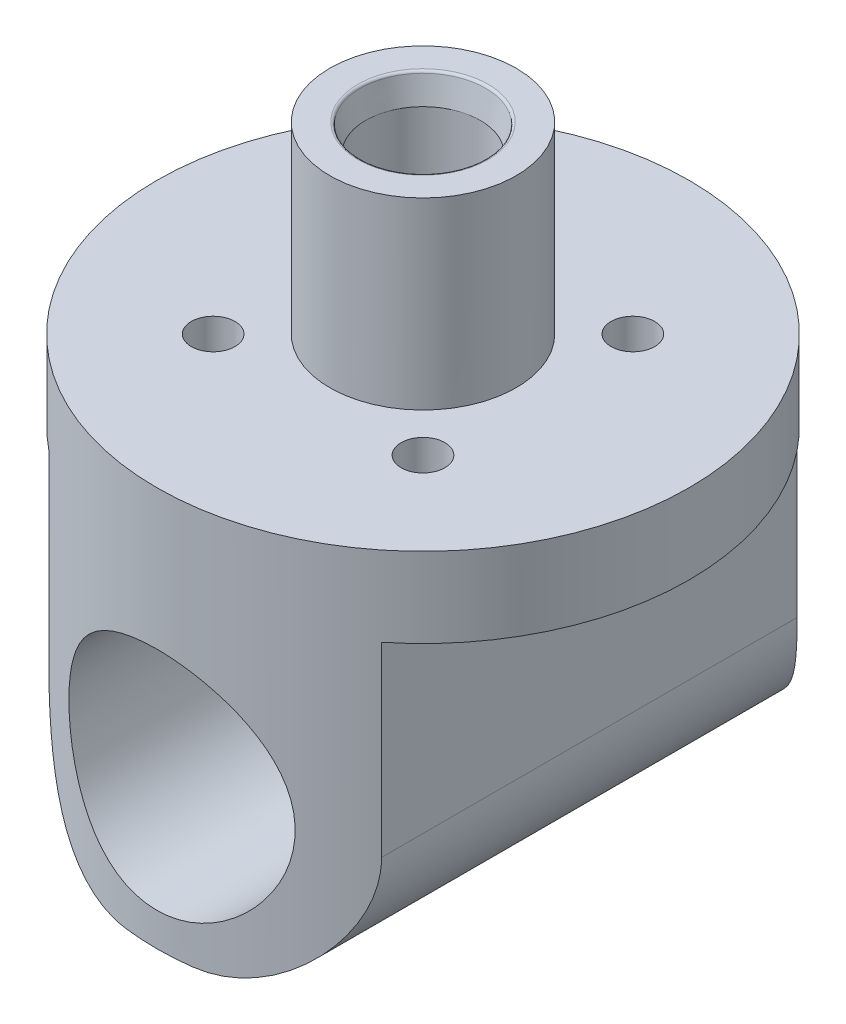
from build123d import *

# Parameters (mm, degrees)
CUT_EXTRUDE1_DEPTH              = 53.363441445
CUT_EXTRUDE1_DEPTH_BACK         = 53.363441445
SKETCH22_W                      = 9.525
SKETCH22_H                      = 30.48
CUT_EXTRUDE2_DEPTH              = 62.647348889
CUT_EXTRUDE2_DEPTH_BACK         = 62.647348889
SKETCH23_R                      = 10.795
F_8_32_TAPPED_HOLE1_D           = 3.4544
F_8_32_TAPPED_HOLE1_DEPTH       = 13.2588
F_8_32_TAPPED_HOLE1_CBORE_D     = 4.1656
F_8_32_TAPPED_HOLE1_CBORE_DEPTH = 11.43
F_8_32_TAPPED_HOLE1_TIP         = 1.037806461
FILLET2_R                       = 12.7


with BuildPart() as part:
    # Sketch2 → Revolve1 (revolve)
    with BuildSketch(Plane.XY):
        Polygon((-25.4, 0), (-8.89, 0), (-8.89, 17.78), (0, 17.78), (0, -38.1), (-25.4, -38.1), align=None)
    revolve(axis=Axis((0, 55.819657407, 0), (0, -1, 0)))

    # Port Sketch → SAE Port (revolve, cut)
    with BuildSketch(Plane(origin=(1.554469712, 17.78, -2.546191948), x_dir=(-0.5210749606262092, 0, 0.8535109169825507), z_dir=(0.8535109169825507, 0, 0.5210749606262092)), mode=Mode.PRIVATE) as sae_port_sk:
        with BuildLine():
            Line((2.983197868, 36.83), (7.943817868, 33.849358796))
            Line((7.943817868, 33.849358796), (7.943817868, 11.754))
            Line((7.943817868, 11.754), (8.539447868, 11.754))
            Line((8.539447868, 11.754), (8.539447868, 2.764417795))
            Line((8.539447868, 2.764417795), (8.449865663, 2.854))
            Line((8.449865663, 2.854), (8.959748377, 0.455190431))
            ThreePointArc((8.959748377, 0.455190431), (9.048350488, 0.310604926), (9.208197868, 0.254))
            Line((9.208197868, 0.254), (13.483197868, 0.254))
            Line((13.483197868, 0.254), (13.483197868, 0))
            Line((13.483197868, 0), (2.983197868, 0))
            Line((2.983197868, 0), (2.983197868, 36.83))
        make_face()
    revolve(sae_port_sk.sketch.rotate(Axis((0, 17.78, 0), (0, -1, 0)), 328.595614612), axis=Axis((0, 17.78, 0), (0, -1, 0)), mode=Mode.SUBTRACT)

    # Sketch22 → Cut-Extrude1 (cut, two sides: drawn at the far end of the back side and taken through both)
    with BuildSketch(Plane.XY.offset(-CUT_EXTRUDE1_DEPTH_BACK)):
        with Locations((-20.6375, -22.86)):
            Rectangle(SKETCH22_W, SKETCH22_H)
        with Locations((20.6375, -22.86)):
            Rectangle(SKETCH22_W, SKETCH22_H)
    extrude(amount=CUT_EXTRUDE1_DEPTH + CUT_EXTRUDE1_DEPTH_BACK, mode=Mode.SUBTRACT)

    # Sketch23 → Cut-Extrude2 (cut, two sides: drawn at the far end of the back side and taken through both)
    with BuildSketch(Plane(origin=(-15.875, 0, 0), x_dir=(-1, 0, 0), z_dir=(0, 0, -1)).offset(-CUT_EXTRUDE2_DEPTH_BACK)):
        with Locations((-15.875, -24.13)):
            Circle(SKETCH23_R)
    extrude(amount=CUT_EXTRUDE2_DEPTH + CUT_EXTRUDE2_DEPTH_BACK, mode=Mode.SUBTRACT)

    # 8-32 Tapped Hole1
    with Locations(Plane(origin=(0, 0, 0), x_dir=(1, 0, 0), z_dir=(0, 1, 0))):
        with Locations((10.012985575, -10.012985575), (10.012985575, 10.012985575), (-10.012985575, 10.012985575), (-10.012985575, -10.012985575)):
            CounterBoreHole(F_8_32_TAPPED_HOLE1_D / 2, F_8_32_TAPPED_HOLE1_CBORE_D / 2, F_8_32_TAPPED_HOLE1_CBORE_DEPTH, depth=F_8_32_TAPPED_HOLE1_DEPTH)
            with Locations((0, 0, -(F_8_32_TAPPED_HOLE1_DEPTH + F_8_32_TAPPED_HOLE1_TIP / 2))):  # 118° drill point
                Cone(0, F_8_32_TAPPED_HOLE1_D / 2, F_8_32_TAPPED_HOLE1_TIP, mode=Mode.SUBTRACT)

    # Fillet2
    fillet2_edges = [part.edges().sort_by_distance(p)[0] for p in [
        (-15.875, -38.1, 0),
        (15.875, -38.1, 0),
    ]]
    fillet(fillet2_edges, radius=FILLET2_R)


solid = part.part
